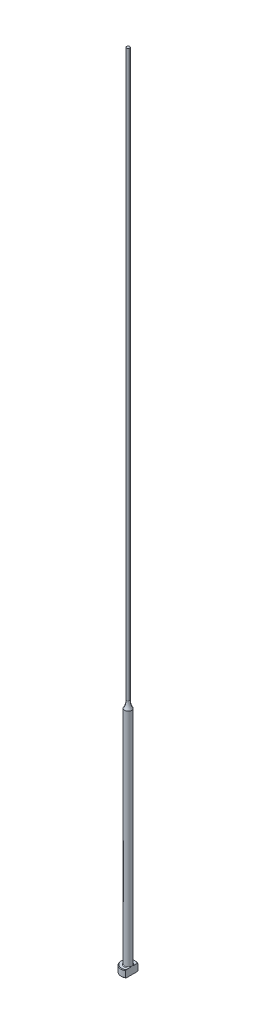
ISO-10303-21;
HEADER;
FILE_DESCRIPTION(('STEP AP214'),'2;1');
FILE_NAME('part.step','',(''),(''),'','','');
FILE_SCHEMA(('AUTOMOTIVE_DESIGN { 1 0 10303 214 1 1 1 1 }'));
ENDSEC;
DATA;
#1=APPLICATION_CONTEXT('core data for automotive mechanical design processes');
#2=APPLICATION_PROTOCOL_DEFINITION('international standard','automotive_design',2000,#1);
#3=PRODUCT_CONTEXT('',#1,'mechanical');
#4=PRODUCT('Part','Part','',(#3));
#5=PRODUCT_RELATED_PRODUCT_CATEGORY('part','',(#4));
#6=PRODUCT_DEFINITION_FORMATION('','',#4);
#7=PRODUCT_DEFINITION_CONTEXT('part definition',#1,'design');
#8=PRODUCT_DEFINITION('design','',#6,#7);
#9=PRODUCT_DEFINITION_SHAPE('','',#8);
#10=(LENGTH_UNIT() NAMED_UNIT(*) SI_UNIT(.MILLI.,.METRE.));
#11=(NAMED_UNIT(*) PLANE_ANGLE_UNIT() SI_UNIT($,.RADIAN.));
#12=(NAMED_UNIT(*) SI_UNIT($,.STERADIAN.) SOLID_ANGLE_UNIT());
#13=UNCERTAINTY_MEASURE_WITH_UNIT(LENGTH_MEASURE(1.E-05),#10,'distance_accuracy_value','');
#14=(GEOMETRIC_REPRESENTATION_CONTEXT(3) GLOBAL_UNCERTAINTY_ASSIGNED_CONTEXT((#13)) GLOBAL_UNIT_ASSIGNED_CONTEXT((#10,
#11,#12)) REPRESENTATION_CONTEXT('',''));
#15=CARTESIAN_POINT('',(0.,0.,0.));
#16=DIRECTION('',(0.,0.,1.));
#17=DIRECTION('',(1.,0.,0.));
#18=AXIS2_PLACEMENT_3D('',#15,#16,#17);
#19=CARTESIAN_POINT('',(-3.17499999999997,3.175,0.));
#20=DIRECTION('',(0.,1.,0.));
#21=DIRECTION('',(0.,0.,1.));
#22=AXIS2_PLACEMENT_3D('',#19,#20,#21);
#23=PLANE('',#22);
#24=CARTESIAN_POINT('',(0.,3.175,0.));
#25=DIRECTION('',(0.,1.,0.));
#26=DIRECTION('',(0.,0.,1.));
#27=AXIS2_PLACEMENT_3D('',#24,#25,#26);
#28=CIRCLE('',#27,2.92099999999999);
#29=CARTESIAN_POINT('',(1.58749999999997,3.175,-2.4519552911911));
#30=VERTEX_POINT('',#29);
#31=CARTESIAN_POINT('',(1.58749999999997,3.175,2.4519552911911));
#32=VERTEX_POINT('',#31);
#33=EDGE_CURVE('E105',#30,#32,#28,.T.);
#34=ORIENTED_EDGE('',*,*,#33,.T.);
#35=DIRECTION('',(0.,0.,1.));
#36=VECTOR('',#35,1.);
#37=CARTESIAN_POINT('',(1.58749999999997,3.17499999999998,2.74963065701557));
#38=LINE('',#37,#36);
#39=CARTESIAN_POINT('',(1.58749999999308,3.175,0.933255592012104));
#40=VERTEX_POINT('',#39);
#41=EDGE_CURVE('E126',#40,#32,#38,.T.);
#42=ORIENTED_EDGE('',*,*,#41,.F.);
#43=CARTESIAN_POINT('',(0.,3.175,0.));
#44=DIRECTION('',(0.,1.,0.));
#45=DIRECTION('',(0.,0.,1.));
#46=AXIS2_PLACEMENT_3D('',#43,#44,#45);
#47=CIRCLE('',#46,1.84149999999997);
#48=CARTESIAN_POINT('',(1.58749999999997,3.17500000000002,-0.933255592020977));
#49=VERTEX_POINT('',#48);
#50=EDGE_CURVE('E11',#40,#49,#47,.F.);
#51=ORIENTED_EDGE('',*,*,#50,.T.);
#52=EDGE_CURVE('E52',#30,#49,#38,.T.);
#53=ORIENTED_EDGE('',*,*,#52,.F.);
#54=EDGE_LOOP('',(#34,#42,#51,#53));
#55=FACE_BOUND('',#54,.T.);
#56=ADVANCED_FACE('F32',(#55),#23,.T.);
#57=CARTESIAN_POINT('',(0.,259.958771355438,0.));
#58=DIRECTION('',(0.,1.,0.));
#59=DIRECTION('',(0.,0.,1.));
#60=AXIS2_PLACEMENT_3D('',#57,#58,#59);
#61=CYLINDRICAL_SURFACE('',#60,3.17499999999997);
#62=CARTESIAN_POINT('',(0.,2.92100000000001,0.));
#63=DIRECTION('',(0.,1.,0.));
#64=DIRECTION('',(0.,0.,1.));
#65=AXIS2_PLACEMENT_3D('',#62,#63,#64);
#66=CIRCLE('',#65,3.17499999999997);
#67=CARTESIAN_POINT('',(1.58749999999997,2.92100000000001,2.74963065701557));
#68=VERTEX_POINT('',#67);
#69=CARTESIAN_POINT('',(1.58749999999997,2.92100000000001,-2.74963065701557));
#70=VERTEX_POINT('',#69);
#71=EDGE_CURVE('E98',#68,#70,#66,.F.);
#72=ORIENTED_EDGE('',*,*,#71,.T.);
#73=DIRECTION('',(0.,-1.,0.));
#74=VECTOR('',#73,1.);
#75=CARTESIAN_POINT('',(1.58749999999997,355.601,-2.74963065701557));
#76=LINE('',#75,#74);
#77=CARTESIAN_POINT('',(1.58749999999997,0.253999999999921,-2.74963065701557));
#78=VERTEX_POINT('',#77);
#79=EDGE_CURVE('E141',#70,#78,#76,.T.);
#80=ORIENTED_EDGE('',*,*,#79,.T.);
#81=CARTESIAN_POINT('',(0.,0.253999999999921,0.));
#82=DIRECTION('',(0.,-1.,0.));
#83=DIRECTION('',(0.,0.,-1.));
#84=AXIS2_PLACEMENT_3D('',#81,#82,#83);
#85=CIRCLE('',#84,3.17499999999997);
#86=CARTESIAN_POINT('',(1.58749999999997,0.253999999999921,2.74963065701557));
#87=VERTEX_POINT('',#86);
#88=EDGE_CURVE('E95',#78,#87,#85,.F.);
#89=ORIENTED_EDGE('',*,*,#88,.T.);
#90=DIRECTION('',(0.,-1.,0.));
#91=VECTOR('',#90,1.);
#92=CARTESIAN_POINT('',(1.58749999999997,355.601,2.74963065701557));
#93=LINE('',#92,#91);
#94=EDGE_CURVE('E88',#68,#87,#93,.T.);
#95=ORIENTED_EDGE('',*,*,#94,.F.);
#96=EDGE_LOOP('',(#72,#80,#89,#95));
#97=FACE_BOUND('',#96,.T.);
#98=ADVANCED_FACE('F191',(#97),#61,.T.);
#99=CARTESIAN_POINT('',(0.,0.,0.));
#100=DIRECTION('',(0.,-1.,0.));
#101=DIRECTION('',(0.,0.,-1.));
#102=AXIS2_PLACEMENT_3D('',#99,#100,#101);
#103=PLANE('',#102);
#104=CARTESIAN_POINT('',(0.,0.,0.));
#105=DIRECTION('',(0.,-1.,0.));
#106=DIRECTION('',(0.,0.,-1.));
#107=AXIS2_PLACEMENT_3D('',#104,#105,#106);
#108=CIRCLE('',#107,2.92100000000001);
#109=CARTESIAN_POINT('',(1.58749999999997,0.,2.45195529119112));
#110=VERTEX_POINT('',#109);
#111=CARTESIAN_POINT('',(1.58749999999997,0.,-2.45195529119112));
#112=VERTEX_POINT('',#111);
#113=EDGE_CURVE('E93',#110,#112,#108,.T.);
#114=ORIENTED_EDGE('',*,*,#113,.T.);
#115=DIRECTION('',(0.,0.,1.));
#116=VECTOR('',#115,1.);
#117=CARTESIAN_POINT('',(1.58749999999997,0.,2.74963065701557));
#118=LINE('',#117,#116);
#119=EDGE_CURVE('E78',#112,#110,#118,.T.);
#120=ORIENTED_EDGE('',*,*,#119,.T.);
#121=EDGE_LOOP('',(#114,#120));
#122=FACE_BOUND('',#121,.T.);
#123=ADVANCED_FACE('F97',(#122),#103,.T.);
#124=CARTESIAN_POINT('',(0.,3.17499999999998,0.));
#125=DIRECTION('',(0.,-1.,0.));
#126=DIRECTION('',(0.,0.,-1.));
#127=AXIS2_PLACEMENT_3D('',#124,#125,#126);
#128=CONICAL_SURFACE('',#127,2.92100000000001,0.785398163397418);
#129=ORIENTED_EDGE('',*,*,#71,.F.);
#130=CARTESIAN_POINT('',(1.58749999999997,-0.161620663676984,-6.0529050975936));
#131=CARTESIAN_POINT('',(1.58749999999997,-0.0288893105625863,-5.91567682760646));
#132=CARTESIAN_POINT('',(1.58749999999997,0.103699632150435,-5.77831035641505));
#133=CARTESIAN_POINT('',(1.58749999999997,0.368508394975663,-5.50321874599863));
#134=CARTESIAN_POINT('',(1.58749999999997,0.5007282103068,-5.3654936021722));
#135=CARTESIAN_POINT('',(1.58749999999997,0.764778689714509,-5.08953516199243));
#136=CARTESIAN_POINT('',(1.58749999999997,0.896609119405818,-4.95130164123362));
#137=CARTESIAN_POINT('',(1.58749999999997,1.15968706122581,-4.67428233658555));
#138=CARTESIAN_POINT('',(1.58749999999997,1.29093457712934,-4.5354965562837));
#139=CARTESIAN_POINT('',(1.58749999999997,1.55007705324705,-4.25997724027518));
#140=CARTESIAN_POINT('',(1.58749999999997,1.67798684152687,-4.12325766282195));
#141=CARTESIAN_POINT('',(1.58749999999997,1.9328486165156,-3.84892898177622));
#142=CARTESIAN_POINT('',(1.58749999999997,2.05980060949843,-3.71131988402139));
#143=CARTESIAN_POINT('',(1.58749999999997,2.31237508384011,-3.43493978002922));
#144=CARTESIAN_POINT('',(1.58749999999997,2.43799784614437,-3.29616903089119));
#145=CARTESIAN_POINT('',(1.58749999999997,2.68741369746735,-3.01699558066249));
#146=CARTESIAN_POINT('',(1.58749999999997,2.81120686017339,-2.8765929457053));
#147=CARTESIAN_POINT('',(1.58749999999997,3.00875865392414,-2.64816703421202));
#148=CARTESIAN_POINT('',(1.58749999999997,3.08336151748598,-2.56087478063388));
#149=CARTESIAN_POINT('',(1.58749999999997,3.23123871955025,-2.385154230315));
#150=CARTESIAN_POINT('',(1.58749999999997,3.30451292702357,-2.29672582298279));
#151=CARTESIAN_POINT('',(1.58749999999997,3.45004422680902,-2.11747400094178));
#152=CARTESIAN_POINT('',(1.58749999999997,3.52228237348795,-2.02663514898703));
#153=CARTESIAN_POINT('',(1.58749999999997,3.66423097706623,-1.84302524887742));
#154=CARTESIAN_POINT('',(1.58749999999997,3.73394203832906,-1.75025467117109));
#155=CARTESIAN_POINT('',(1.58749999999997,3.87080633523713,-1.56067475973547));
#156=CARTESIAN_POINT('',(1.58749999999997,3.93790459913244,-1.46382547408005));
#157=CARTESIAN_POINT('',(1.58749999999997,4.06669147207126,-1.26632594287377));
#158=CARTESIAN_POINT('',(1.58749999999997,4.12837264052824,-1.16567073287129));
#159=CARTESIAN_POINT('',(1.58749999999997,4.21402252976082,-1.01165766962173));
#160=CARTESIAN_POINT('',(1.58749999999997,4.2412792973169,-0.960142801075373));
#161=CARTESIAN_POINT('',(1.58749999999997,4.29309798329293,-0.85578092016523));
#162=CARTESIAN_POINT('',(1.58749999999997,4.3176594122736,-0.802933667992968));
#163=CARTESIAN_POINT('',(1.58749999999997,4.38614656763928,-0.642461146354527));
#164=CARTESIAN_POINT('',(1.58749999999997,4.42510149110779,-0.532518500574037));
#165=CARTESIAN_POINT('',(1.58749999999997,4.46726244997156,-0.367680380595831));
#166=CARTESIAN_POINT('',(1.58749999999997,4.47844427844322,-0.314802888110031));
#167=CARTESIAN_POINT('',(1.58749999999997,4.49576654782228,-0.208209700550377));
#168=CARTESIAN_POINT('',(1.58749999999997,4.50190743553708,-0.154494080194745));
#169=CARTESIAN_POINT('',(1.58749999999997,4.50871296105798,-0.0468792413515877));
#170=CARTESIAN_POINT('',(1.58749999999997,4.50939451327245,0.00701889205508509));
#171=CARTESIAN_POINT('',(1.58749999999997,4.5052767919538,0.114606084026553));
#172=CARTESIAN_POINT('',(1.58749999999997,4.5004770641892,0.16829512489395));
#173=CARTESIAN_POINT('',(1.58749999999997,4.48579689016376,0.274485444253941));
#174=CARTESIAN_POINT('',(1.58749999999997,4.47596081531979,0.326992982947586));
#175=CARTESIAN_POINT('',(1.58749999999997,4.4518180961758,0.430974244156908));
#176=CARTESIAN_POINT('',(1.58749999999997,4.43750969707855,0.482447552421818));
#177=CARTESIAN_POINT('',(1.58749999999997,4.40502489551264,0.58446088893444));
#178=CARTESIAN_POINT('',(1.58749999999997,4.38682724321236,0.634994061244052));
#179=CARTESIAN_POINT('',(1.58749999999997,4.34729308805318,0.734789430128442));
#180=CARTESIAN_POINT('',(1.58749999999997,4.32595722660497,0.784051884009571));
#181=CARTESIAN_POINT('',(1.58749999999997,4.25791922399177,0.93054934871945));
#182=CARTESIAN_POINT('',(1.58749999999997,4.20736047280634,1.02598802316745));
#183=CARTESIAN_POINT('',(1.58749999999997,4.09955451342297,1.21304313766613));
#184=CARTESIAN_POINT('',(1.58749999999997,4.04229912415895,1.30465471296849));
#185=CARTESIAN_POINT('',(1.58749999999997,3.92308746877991,1.48526211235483));
#186=CARTESIAN_POINT('',(1.58749999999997,3.86111349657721,1.57424615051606));
#187=CARTESIAN_POINT('',(1.58749999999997,3.73408621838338,1.74990003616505));
#188=CARTESIAN_POINT('',(1.58749999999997,3.66903444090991,1.83657099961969));
#189=CARTESIAN_POINT('',(1.58749999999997,3.53583371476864,2.009317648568));
#190=CARTESIAN_POINT('',(1.58749999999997,3.46765527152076,2.09537048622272));
#191=CARTESIAN_POINT('',(1.58749999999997,3.32960643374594,2.26611736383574));
#192=CARTESIAN_POINT('',(1.58749999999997,3.25973586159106,2.35081125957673));
#193=CARTESIAN_POINT('',(1.58749999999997,3.04858139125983,2.60290121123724));
#194=CARTESIAN_POINT('',(1.58749999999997,2.90542388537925,2.7687253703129));
#195=CARTESIAN_POINT('',(1.58749999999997,2.64069522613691,3.06970913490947));
#196=CARTESIAN_POINT('',(1.58749999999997,2.5195945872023,3.20528660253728));
#197=CARTESIAN_POINT('',(1.58749999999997,2.27590400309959,3.47510321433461));
#198=CARTESIAN_POINT('',(1.58749999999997,2.1533140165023,3.60934232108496));
#199=CARTESIAN_POINT('',(1.58749999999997,1.9069423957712,3.87695374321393));
#200=CARTESIAN_POINT('',(1.58749999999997,1.78315974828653,4.01032512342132));
#201=CARTESIAN_POINT('',(1.58749999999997,1.53478104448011,4.2763088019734));
#202=CARTESIAN_POINT('',(1.58749999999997,1.41018498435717,4.40892109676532));
#203=CARTESIAN_POINT('',(1.58749999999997,1.04574684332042,4.79499418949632));
#204=CARTESIAN_POINT('',(1.58749999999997,0.805076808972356,5.04767313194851));
#205=CARTESIAN_POINT('',(1.58749999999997,0.44312150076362,5.42550911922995));
#206=CARTESIAN_POINT('',(1.58749999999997,0.322378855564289,5.55118772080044));
#207=CARTESIAN_POINT('',(1.58749999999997,0.0805914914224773,5.8022520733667));
#208=CARTESIAN_POINT('',(1.58749999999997,-0.0404532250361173,5.92763782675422));
#209=CARTESIAN_POINT('',(1.58749999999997,-0.161620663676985,6.0529050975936));
#210=B_SPLINE_CURVE_WITH_KNOTS('',3,(#130,#131,#132,#133,#134,#135,#136,#137,#138,#139,#140,
#141,#142,#143,#144,#145,#146,#147,#148,#149,#150,#151,#152,#153,#154,#155,#156,#157,#158,#159,
#160,#161,#162,#163,#164,#165,#166,#167,#168,#169,#170,#171,#172,#173,#174,#175,#176,#177,#178,
#179,#180,#181,#182,#183,#184,#185,#186,#187,#188,#189,#190,#191,#192,#193,#194,#195,#196,#197,
#198,#199,#200,#201,#202,#203,#204,#205,#206,#207,#208,#209),.UNSPECIFIED.,.F.,.F.,(4,2,2,2,2,2,
2,2,2,2,2,2,2,2,2,2,2,2,2,2,2,2,2,2,2,2,2,2,2,2,2,2,2,2,2,2,2,2,2,4),(0.,0.572750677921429,
1.14550874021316,1.71856057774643,2.29160869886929,2.85328006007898,3.41494773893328,
3.97649423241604,4.53801804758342,4.88249307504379,5.2270018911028,5.57515326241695,
5.92322081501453,6.27657800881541,6.63041319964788,6.80518126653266,6.97998101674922,
7.32824262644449,7.49018491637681,7.65211285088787,7.81353889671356,7.97497832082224,
8.13501929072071,8.29512313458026,8.45612518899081,8.61709438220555,8.94062993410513,
9.26456495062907,9.58978187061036,9.91483894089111,10.2441741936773,10.5735441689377,
11.2306812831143,11.7760337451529,12.3214014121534,12.8672825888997,13.4131663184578,
14.4600164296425,14.9828595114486,15.505698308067),.UNSPECIFIED.);
#211=EDGE_CURVE('E118',#32,#68,#210,.T.);
#212=ORIENTED_EDGE('',*,*,#211,.F.);
#213=ORIENTED_EDGE('',*,*,#33,.F.);
#214=EDGE_CURVE('E117',#70,#30,#210,.T.);
#215=ORIENTED_EDGE('',*,*,#214,.F.);
#216=EDGE_LOOP('',(#129,#212,#213,#215));
#217=FACE_BOUND('',#216,.T.);
#218=ADVANCED_FACE('F162',(#217),#128,.T.);
#219=CARTESIAN_POINT('',(0.,0.253999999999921,0.));
#220=DIRECTION('',(0.,1.,0.));
#221=DIRECTION('',(0.,0.,1.));
#222=AXIS2_PLACEMENT_3D('',#219,#220,#221);
#223=CONICAL_SURFACE('',#222,3.17499999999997,0.785398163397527);
#224=ORIENTED_EDGE('',*,*,#88,.F.);
#225=CARTESIAN_POINT('',(1.58749999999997,3.33662066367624,6.0529050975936));
#226=CARTESIAN_POINT('',(1.58749999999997,3.20388931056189,5.91567682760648));
#227=CARTESIAN_POINT('',(1.58749999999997,3.07130036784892,5.7783103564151));
#228=CARTESIAN_POINT('',(1.58749999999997,2.80649160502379,5.50321874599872));
#229=CARTESIAN_POINT('',(1.58749999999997,2.6742717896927,5.36549360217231));
#230=CARTESIAN_POINT('',(1.58749999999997,2.41022131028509,5.08953516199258));
#231=CARTESIAN_POINT('',(1.58749999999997,2.27839088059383,4.95130164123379));
#232=CARTESIAN_POINT('',(1.58749999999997,2.01531293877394,4.67428233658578));
#233=CARTESIAN_POINT('',(1.58749999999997,1.88406542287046,4.53549655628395));
#234=CARTESIAN_POINT('',(1.58749999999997,1.62492294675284,4.25997724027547));
#235=CARTESIAN_POINT('',(1.58749999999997,1.49701315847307,4.12325766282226));
#236=CARTESIAN_POINT('',(1.58749999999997,1.24215138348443,3.84892898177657));
#237=CARTESIAN_POINT('',(1.58749999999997,1.11519939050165,3.71131988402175));
#238=CARTESIAN_POINT('',(1.58749999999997,0.862624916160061,3.43493978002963));
#239=CARTESIAN_POINT('',(1.58749999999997,0.737002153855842,3.29616903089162));
#240=CARTESIAN_POINT('',(1.58749999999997,0.487586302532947,3.01699558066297));
#241=CARTESIAN_POINT('',(1.58749999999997,0.363793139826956,2.8765929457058));
#242=CARTESIAN_POINT('',(1.58749999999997,0.166241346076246,2.64816703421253));
#243=CARTESIAN_POINT('',(1.58749999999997,0.0916384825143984,2.56087478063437));
#244=CARTESIAN_POINT('',(1.58749999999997,-0.0562387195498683,2.38515423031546));
#245=CARTESIAN_POINT('',(1.58749999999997,-0.129512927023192,2.29672582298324));
#246=CARTESIAN_POINT('',(1.58749999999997,-0.275044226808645,2.1174740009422));
#247=CARTESIAN_POINT('',(1.58749999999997,-0.347282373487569,2.02663514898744));
#248=CARTESIAN_POINT('',(1.58749999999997,-0.489230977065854,1.8430252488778));
#249=CARTESIAN_POINT('',(1.58749999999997,-0.558942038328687,1.75025467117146));
#250=CARTESIAN_POINT('',(1.58749999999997,-0.695806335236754,1.5606747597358));
#251=CARTESIAN_POINT('',(1.58749999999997,-0.762904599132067,1.46382547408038));
#252=CARTESIAN_POINT('',(1.58749999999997,-0.89169147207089,1.26632594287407));
#253=CARTESIAN_POINT('',(1.58749999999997,-0.953372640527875,1.16567073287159));
#254=CARTESIAN_POINT('',(1.58749999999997,-1.03902252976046,1.01165766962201));
#255=CARTESIAN_POINT('',(1.58749999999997,-1.06627929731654,0.960142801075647));
#256=CARTESIAN_POINT('',(1.58749999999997,-1.11809798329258,0.855780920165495));
#257=CARTESIAN_POINT('',(1.58749999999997,-1.14265941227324,0.802933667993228));
#258=CARTESIAN_POINT('',(1.58749999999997,-1.21114656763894,0.642461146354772));
#259=CARTESIAN_POINT('',(1.58749999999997,-1.25010149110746,0.532518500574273));
#260=CARTESIAN_POINT('',(1.58749999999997,-1.29226244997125,0.367680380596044));
#261=CARTESIAN_POINT('',(1.58749999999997,-1.30344427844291,0.314802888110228));
#262=CARTESIAN_POINT('',(1.58749999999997,-1.32076654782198,0.208209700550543));
#263=CARTESIAN_POINT('',(1.58749999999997,-1.32690743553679,0.154494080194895));
#264=CARTESIAN_POINT('',(1.58749999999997,-1.3337129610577,0.0468792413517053));
#265=CARTESIAN_POINT('',(1.58749999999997,-1.33439451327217,-0.00701889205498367));
#266=CARTESIAN_POINT('',(1.58749999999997,-1.33027679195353,-0.114606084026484));
#267=CARTESIAN_POINT('',(1.58749999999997,-1.32547706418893,-0.168295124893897));
#268=CARTESIAN_POINT('',(1.58749999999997,-1.31079689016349,-0.274485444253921));
#269=CARTESIAN_POINT('',(1.58749999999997,-1.30096081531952,-0.326992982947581));
#270=CARTESIAN_POINT('',(1.58749999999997,-1.27681809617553,-0.430974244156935));
#271=CARTESIAN_POINT('',(1.58749999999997,-1.26250969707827,-0.48244755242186));
#272=CARTESIAN_POINT('',(1.58749999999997,-1.23002489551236,-0.584460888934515));
#273=CARTESIAN_POINT('',(1.58749999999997,-1.21182724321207,-0.634994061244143));
#274=CARTESIAN_POINT('',(1.58749999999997,-1.17229308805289,-0.734789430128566));
#275=CARTESIAN_POINT('',(1.58749999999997,-1.15095722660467,-0.784051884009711));
#276=CARTESIAN_POINT('',(1.58749999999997,-1.08291922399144,-0.930549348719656));
#277=CARTESIAN_POINT('',(1.58749999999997,-1.03236047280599,-1.0259880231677));
#278=CARTESIAN_POINT('',(1.58749999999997,-0.924554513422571,-1.21304313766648));
#279=CARTESIAN_POINT('',(1.58749999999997,-0.867299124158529,-1.30465471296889));
#280=CARTESIAN_POINT('',(1.58749999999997,-0.748087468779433,-1.48526211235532));
#281=CARTESIAN_POINT('',(1.58749999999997,-0.686113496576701,-1.5742461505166));
#282=CARTESIAN_POINT('',(1.58749999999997,-0.559086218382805,-1.74990003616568));
#283=CARTESIAN_POINT('',(1.58749999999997,-0.494034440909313,-1.83657099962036));
#284=CARTESIAN_POINT('',(1.58749999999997,-0.360833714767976,-2.00931764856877));
#285=CARTESIAN_POINT('',(1.58749999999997,-0.292655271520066,-2.09537048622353));
#286=CARTESIAN_POINT('',(1.58749999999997,-0.154606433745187,-2.26611736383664));
#287=CARTESIAN_POINT('',(1.58749999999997,-0.0847358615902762,-2.35081125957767));
#288=CARTESIAN_POINT('',(1.58749999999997,0.126418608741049,-2.60290121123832));
#289=CARTESIAN_POINT('',(1.58749999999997,0.269576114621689,-2.76872537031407));
#290=CARTESIAN_POINT('',(1.58749999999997,0.534304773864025,-3.06970913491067));
#291=CARTESIAN_POINT('',(1.58749999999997,0.655405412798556,-3.20528660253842));
#292=CARTESIAN_POINT('',(1.58749999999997,0.899095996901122,-3.47510321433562));
#293=CARTESIAN_POINT('',(1.58749999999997,1.02168598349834,-3.60934232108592));
#294=CARTESIAN_POINT('',(1.58749999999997,1.26805760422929,-3.87695374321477));
#295=CARTESIAN_POINT('',(1.58749999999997,1.39184025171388,-4.0103251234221));
#296=CARTESIAN_POINT('',(1.58749999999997,1.64021895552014,-4.27630880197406));
#297=CARTESIAN_POINT('',(1.58749999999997,1.76481501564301,-4.40892109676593));
#298=CARTESIAN_POINT('',(1.58749999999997,2.12925315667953,-4.79499418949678));
#299=CARTESIAN_POINT('',(1.58749999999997,2.36992319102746,-5.04767313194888));
#300=CARTESIAN_POINT('',(1.58749999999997,2.73187849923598,-5.42550911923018));
#301=CARTESIAN_POINT('',(1.58749999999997,2.85262114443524,-5.55118772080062));
#302=CARTESIAN_POINT('',(1.58749999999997,3.09440850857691,-5.80225207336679));
#303=CARTESIAN_POINT('',(1.58749999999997,3.21545322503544,-5.92763782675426));
#304=CARTESIAN_POINT('',(1.58749999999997,3.33662066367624,-6.0529050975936));
#305=B_SPLINE_CURVE_WITH_KNOTS('',3,(#225,#226,#227,#228,#229,#230,#231,#232,#233,#234,#235,
#236,#237,#238,#239,#240,#241,#242,#243,#244,#245,#246,#247,#248,#249,#250,#251,#252,#253,#254,
#255,#256,#257,#258,#259,#260,#261,#262,#263,#264,#265,#266,#267,#268,#269,#270,#271,#272,#273,
#274,#275,#276,#277,#278,#279,#280,#281,#282,#283,#284,#285,#286,#287,#288,#289,#290,#291,#292,
#293,#294,#295,#296,#297,#298,#299,#300,#301,#302,#303,#304),.UNSPECIFIED.,.F.,.F.,(4,2,2,2,2,2,
2,2,2,2,2,2,2,2,2,2,2,2,2,2,2,2,2,2,2,2,2,2,2,2,2,2,2,2,2,2,2,2,2,4),(0.,0.572750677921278,
1.14550874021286,1.71856057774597,2.29160869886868,2.85328006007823,3.4149477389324,
3.97649423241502,4.53801804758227,4.88249307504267,5.22700189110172,5.5751532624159,
5.92322081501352,6.27657800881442,6.63041319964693,6.80518126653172,6.9799810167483,
7.3282426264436,7.49018491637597,7.65211285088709,7.81353889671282,7.97497832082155,
8.13501929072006,8.29512313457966,8.45612518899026,8.61709438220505,8.9406299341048,
9.2645649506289,9.58978187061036,9.91483894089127,10.2441741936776,10.5735441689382,
11.2306812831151,11.7760337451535,12.3214014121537,12.8672825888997,13.4131663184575,
14.4600164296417,14.9828595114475,15.5056983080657),.UNSPECIFIED.);
#306=EDGE_CURVE('E81',#112,#78,#305,.T.);
#307=ORIENTED_EDGE('',*,*,#306,.F.);
#308=ORIENTED_EDGE('',*,*,#113,.F.);
#309=EDGE_CURVE('E84',#87,#110,#305,.T.);
#310=ORIENTED_EDGE('',*,*,#309,.F.);
#311=EDGE_LOOP('',(#224,#307,#308,#310));
#312=FACE_BOUND('',#311,.T.);
#313=ADVANCED_FACE('F92',(#312),#223,.T.);
#314=CARTESIAN_POINT('',(0.,3.42900000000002,0.));
#315=DIRECTION('',(0.,1.,0.));
#316=DIRECTION('',(0.,0.,1.));
#317=AXIS2_PLACEMENT_3D('',#314,#315,#316);
#318=TOROIDAL_SURFACE('',#317,1.84149999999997,0.254);
#319=CARTESIAN_POINT('',(1.58749999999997,3.42900000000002,0.));
#320=CARTESIAN_POINT('',(1.58749999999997,3.42899942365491,-1.9220514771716E-10));
#321=CARTESIAN_POINT('',(1.58749999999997,3.42899884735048,-1.2261161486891E-07));
#322=CARTESIAN_POINT('',(1.58749999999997,3.42899773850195,-5.09676365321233E-07));
#323=CARTESIAN_POINT('',(1.58749999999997,3.42899720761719,-7.78176328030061E-07));
#324=CARTESIAN_POINT('',(1.58749999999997,3.42899614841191,-1.42307272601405E-06));
#325=CARTESIAN_POINT('',(1.58749999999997,3.42899562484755,-1.80713867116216E-06));
#326=CARTESIAN_POINT('',(1.58749999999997,3.42899463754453,-2.63494846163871E-06));
#327=CARTESIAN_POINT('',(1.58749999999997,3.42899417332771,-3.07814756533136E-06));
#328=CARTESIAN_POINT('',(1.58749999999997,3.42899261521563,-4.66897357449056E-06));
#329=CARTESIAN_POINT('',(1.58749999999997,3.42899159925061,-5.89404908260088E-06));
#330=CARTESIAN_POINT('',(1.58749999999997,3.42898979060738,-8.42427511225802E-06));
#331=CARTESIAN_POINT('',(1.58749999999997,3.42898899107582,-9.7248057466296E-06));
#332=CARTESIAN_POINT('',(1.58749999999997,3.42898598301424,-1.48060601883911E-05));
#333=CARTESIAN_POINT('',(1.58749999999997,3.42898393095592,-1.86838281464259E-05));
#334=CARTESIAN_POINT('',(1.58749999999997,3.42898057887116,-2.63261117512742E-05));
#335=CARTESIAN_POINT('',(1.58749999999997,3.42897922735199,-3.00687417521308E-05));
#336=CARTESIAN_POINT('',(1.58749999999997,3.42897347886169,-4.60276298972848E-05));
#337=CARTESIAN_POINT('',(1.58749999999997,3.42896911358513,-5.8247019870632E-05));
#338=CARTESIAN_POINT('',(1.58749999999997,3.42896211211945,-8.11070097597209E-05));
#339=CARTESIAN_POINT('',(1.58749999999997,3.42895931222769,-9.16953114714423E-05));
#340=CARTESIAN_POINT('',(1.58749999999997,3.42893712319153,-0.000168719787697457));
#341=CARTESIAN_POINT('',(1.58749999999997,3.42890881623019,-0.000232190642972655));
#342=CARTESIAN_POINT('',(1.58749999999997,3.42880276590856,-0.000479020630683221));
#343=CARTESIAN_POINT('',(1.58749999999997,3.42873165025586,-0.00066443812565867));
#344=CARTESIAN_POINT('',(1.58749999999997,3.42845137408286,-0.0013844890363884));
#345=CARTESIAN_POINT('',(1.58749999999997,3.42823526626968,-0.00191701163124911));
#346=CARTESIAN_POINT('',(1.58749999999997,3.42735449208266,-0.00409774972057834));
#347=CARTESIAN_POINT('',(1.58749999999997,3.42669768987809,-0.00574830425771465));
#348=CARTESIAN_POINT('',(1.58749999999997,3.4174405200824,-0.0289985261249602));
#349=CARTESIAN_POINT('',(1.58749999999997,3.40878325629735,-0.0505816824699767));
#350=CARTESIAN_POINT('',(1.58749999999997,3.39189297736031,-0.0929947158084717));
#351=CARTESIAN_POINT('',(1.58749999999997,3.38365605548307,-0.11382315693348));
#352=CARTESIAN_POINT('',(1.58749999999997,3.36635393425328,-0.157956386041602));
#353=CARTESIAN_POINT('',(1.58749999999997,3.35730391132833,-0.181267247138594));
#354=CARTESIAN_POINT('',(1.58749999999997,3.33936775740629,-0.228222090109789));
#355=CARTESIAN_POINT('',(1.58749999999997,3.33048420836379,-0.25186705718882));
#356=CARTESIAN_POINT('',(1.58749999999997,3.30894496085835,-0.310512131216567));
#357=CARTESIAN_POINT('',(1.58749999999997,3.29649449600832,-0.345588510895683));
#358=CARTESIAN_POINT('',(1.58749999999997,3.27296975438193,-0.415278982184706));
#359=CARTESIAN_POINT('',(1.58749999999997,3.26186987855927,-0.449884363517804));
#360=CARTESIAN_POINT('',(1.58749999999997,3.2395832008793,-0.524471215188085));
#361=CARTESIAN_POINT('',(1.58749999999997,3.22860862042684,-0.564517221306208));
#362=CARTESIAN_POINT('',(1.58749999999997,3.20902534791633,-0.645529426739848));
#363=CARTESIAN_POINT('',(1.58749999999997,3.20043582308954,-0.686500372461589));
#364=CARTESIAN_POINT('',(1.58749999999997,3.18611712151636,-0.771546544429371));
#365=CARTESIAN_POINT('',(1.58749999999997,3.18059550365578,-0.815658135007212));
#366=CARTESIAN_POINT('',(1.58749999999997,3.17455396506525,-0.904117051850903));
#367=CARTESIAN_POINT('',(1.58749999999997,3.17401361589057,-0.948462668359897));
#368=CARTESIAN_POINT('',(1.58749999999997,3.17898948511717,-1.02531896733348));
#369=CARTESIAN_POINT('',(1.58749999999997,3.1829739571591,-1.05792141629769));
#370=CARTESIAN_POINT('',(1.58749999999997,3.19569167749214,-1.12184393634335));
#371=CARTESIAN_POINT('',(1.58749999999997,3.20436049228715,-1.1531753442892));
#372=CARTESIAN_POINT('',(1.58749999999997,3.22236152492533,-1.19946468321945));
#373=CARTESIAN_POINT('',(1.58749999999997,3.2295150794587,-1.21526783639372));
#374=CARTESIAN_POINT('',(1.58749999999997,3.24587062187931,-1.24583726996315));
#375=CARTESIAN_POINT('',(1.58749999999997,3.25507530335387,-1.26060215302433));
#376=CARTESIAN_POINT('',(1.58749999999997,3.27378481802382,-1.28575815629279));
#377=CARTESIAN_POINT('',(1.58749999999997,3.28289001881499,-1.29644383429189));
#378=CARTESIAN_POINT('',(1.58749999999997,3.30268460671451,-1.31623154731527));
#379=CARTESIAN_POINT('',(1.58749999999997,3.31337067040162,-1.32533681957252));
#380=CARTESIAN_POINT('',(1.58749999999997,3.33349977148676,-1.33941140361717));
#381=CARTESIAN_POINT('',(1.58749999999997,3.34261446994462,-1.34484814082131));
#382=CARTESIAN_POINT('',(1.58749999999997,3.36161455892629,-1.35416329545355));
#383=CARTESIAN_POINT('',(1.58749999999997,3.37149946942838,-1.35804267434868));
#384=CARTESIAN_POINT('',(1.58749999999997,3.39188678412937,-1.36398436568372));
#385=CARTESIAN_POINT('',(1.58749999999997,3.40239309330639,-1.36603350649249));
#386=CARTESIAN_POINT('',(1.58749999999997,3.42360372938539,-1.3680840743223));
#387=CARTESIAN_POINT('',(1.58749999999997,3.43430795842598,-1.36808648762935));
#388=CARTESIAN_POINT('',(1.58749999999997,3.45433283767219,-1.36616208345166));
#389=CARTESIAN_POINT('',(1.58749999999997,3.46367506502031,-1.36444960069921));
#390=CARTESIAN_POINT('',(1.58749999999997,3.48195519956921,-1.35953338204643));
#391=CARTESIAN_POINT('',(1.58749999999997,3.49089304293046,-1.3563294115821));
#392=CARTESIAN_POINT('',(1.58749999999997,3.50850302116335,-1.34848006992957));
#393=CARTESIAN_POINT('',(1.58749999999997,3.5171531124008,-1.34378578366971));
#394=CARTESIAN_POINT('',(1.58749999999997,3.53371257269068,-1.33324445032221));
#395=CARTESIAN_POINT('',(1.58749999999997,3.54162163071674,-1.32739692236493));
#396=CARTESIAN_POINT('',(1.58749999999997,3.56107121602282,-1.31107304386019));
#397=CARTESIAN_POINT('',(1.58749999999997,3.57202221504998,-1.29989286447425));
#398=CARTESIAN_POINT('',(1.58749999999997,3.59202509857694,-1.27593566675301));
#399=CARTESIAN_POINT('',(1.58749999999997,3.60107086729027,-1.26315370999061));
#400=CARTESIAN_POINT('',(1.58749999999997,3.62186023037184,-1.22930733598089));
#401=CARTESIAN_POINT('',(1.58749999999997,3.63240584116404,-1.20751096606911));
#402=CARTESIAN_POINT('',(1.58749999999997,3.65004643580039,-1.16266144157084));
#403=CARTESIAN_POINT('',(1.58749999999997,3.65714435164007,-1.13960937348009));
#404=CARTESIAN_POINT('',(1.58749999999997,3.67265428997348,-1.07603916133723));
#405=CARTESIAN_POINT('',(1.58749999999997,3.67834921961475,-1.03486686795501));
#406=CARTESIAN_POINT('',(1.58749999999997,3.68382880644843,-0.951558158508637));
#407=CARTESIAN_POINT('',(1.58749999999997,3.68350976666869,-0.909417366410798));
#408=CARTESIAN_POINT('',(1.58749999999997,3.67745397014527,-0.811383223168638));
#409=CARTESIAN_POINT('',(1.58749999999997,3.66993873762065,-0.755610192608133));
#410=CARTESIAN_POINT('',(1.58749999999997,3.64933373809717,-0.644937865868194));
#411=CARTESIAN_POINT('',(1.58749999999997,3.63621897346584,-0.59004364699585));
#412=CARTESIAN_POINT('',(1.58749999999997,3.60740922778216,-0.485757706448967));
#413=CARTESIAN_POINT('',(1.58749999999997,3.59201096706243,-0.436281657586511));
#414=CARTESIAN_POINT('',(1.58749999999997,3.55922497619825,-0.338551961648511));
#415=CARTESIAN_POINT('',(1.58749999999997,3.5418584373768,-0.290291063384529));
#416=CARTESIAN_POINT('',(1.58749999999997,3.51760237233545,-0.225557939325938));
#417=CARTESIAN_POINT('',(1.58749999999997,3.51126413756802,-0.208874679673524));
#418=CARTESIAN_POINT('',(1.58749999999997,3.49830042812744,-0.17512392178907));
#419=CARTESIAN_POINT('',(1.58749999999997,3.49167176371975,-0.158057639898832));
#420=CARTESIAN_POINT('',(1.58749999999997,3.47585523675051,-0.117638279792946));
#421=CARTESIAN_POINT('',(1.58749999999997,3.46662970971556,-0.0943002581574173));
#422=CARTESIAN_POINT('',(1.58749999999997,3.44889695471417,-0.0497824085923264));
#423=CARTESIAN_POINT('',(1.58749999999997,3.44040039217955,-0.028598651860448));
#424=CARTESIAN_POINT('',(1.58749999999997,3.43130364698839,-0.00575168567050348));
#425=CARTESIAN_POINT('',(1.58749999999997,3.43064818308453,-0.00410451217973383));
#426=CARTESIAN_POINT('',(1.58749999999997,3.42976776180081,-0.00192459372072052));
#427=CARTESIAN_POINT('',(1.58749999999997,3.42955062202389,-0.00138952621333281));
#428=CARTESIAN_POINT('',(1.58749999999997,3.42926908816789,-0.000666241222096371));
#429=CARTESIAN_POINT('',(1.58749999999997,3.42919771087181,-0.000480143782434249));
#430=CARTESIAN_POINT('',(1.58749999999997,3.42909131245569,-0.000232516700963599));
#431=CARTESIAN_POINT('',(1.58749999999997,3.42906294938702,-0.000168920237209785));
#432=CARTESIAN_POINT('',(1.58749999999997,3.42904072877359,-9.17527162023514E-05));
#433=CARTESIAN_POINT('',(1.58749999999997,3.42903792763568,-8.11550293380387E-05));
#434=CARTESIAN_POINT('',(1.58749999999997,3.42903091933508,-5.82743948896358E-05));
#435=CARTESIAN_POINT('',(1.58749999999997,3.42902654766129,-4.60440001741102E-05));
#436=CARTESIAN_POINT('',(1.58749999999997,3.42902079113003,-3.00727682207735E-05));
#437=CARTESIAN_POINT('',(1.58749999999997,3.42901943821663,-2.63286807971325E-05));
#438=CARTESIAN_POINT('',(1.58749999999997,3.42901608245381,-1.86836529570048E-05));
#439=CARTESIAN_POINT('',(1.58749999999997,3.4290140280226,-1.48046517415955E-05));
#440=CARTESIAN_POINT('',(1.58749999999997,3.42901101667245,-9.72223943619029E-06));
#441=CARTESIAN_POINT('',(1.58749999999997,3.42901021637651,-8.42159649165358E-06));
#442=CARTESIAN_POINT('',(1.58749999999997,3.42900840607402,-5.89129729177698E-06));
#443=CARTESIAN_POINT('',(1.58749999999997,3.42900738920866,-4.66626867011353E-06));
#444=CARTESIAN_POINT('',(1.58749999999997,3.42900582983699,-3.07568803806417E-06));
#445=CARTESIAN_POINT('',(1.58749999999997,3.42900536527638,-2.63259565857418E-06));
#446=CARTESIAN_POINT('',(1.58749999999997,3.4290043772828,-1.80506085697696E-06));
#447=CARTESIAN_POINT('',(1.58749999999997,3.42900385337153,-1.42116387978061E-06));
#448=CARTESIAN_POINT('',(1.58749999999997,3.42900279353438,-7.76675643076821E-07));
#449=CARTESIAN_POINT('',(1.58749999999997,3.42900226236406,-5.08406487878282E-07));
#450=CARTESIAN_POINT('',(1.58749999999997,3.42900115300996,-1.21901887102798E-07));
#451=CARTESIAN_POINT('',(1.58749999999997,3.42900057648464,1.92251677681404E-10));
#452=CARTESIAN_POINT('',(1.58749999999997,3.42900000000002,0.));
#453=B_SPLINE_CURVE_WITH_KNOTS('',3,(#319,#320,#321,#322,#323,#324,#325,#326,#327,#328,#329,
#330,#331,#332,#333,#334,#335,#336,#337,#338,#339,#340,#341,#342,#343,#344,#345,#346,#347,#348,
#349,#350,#351,#352,#353,#354,#355,#356,#357,#358,#359,#360,#361,#362,#363,#364,#365,#366,#367,
#368,#369,#370,#371,#372,#373,#374,#375,#376,#377,#378,#379,#380,#381,#382,#383,#384,#385,#386,
#387,#388,#389,#390,#391,#392,#393,#394,#395,#396,#397,#398,#399,#400,#401,#402,#403,#404,#405,
#406,#407,#408,#409,#410,#411,#412,#413,#414,#415,#416,#417,#418,#419,#420,#421,#422,#423,#424,
#425,#426,#427,#428,#429,#430,#431,#432,#433,#434,#435,#436,#437,#438,#439,#440,#441,#442,#443,
#444,#445,#446,#447,#448,#449,#450,#451,#452),.UNSPECIFIED.,.T.,.F.,(4,2,2,2,2,2,2,2,2,2,2,2,2,
2,2,2,2,2,2,2,2,2,2,2,2,2,2,2,2,2,2,2,2,2,2,2,2,2,2,2,2,2,2,2,2,2,2,2,2,2,2,2,2,2,2,2,2,2,2,2,2,
2,2,2,2,2,4),(0.,1.72815458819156E-06,3.50429255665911E-06,5.44431004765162E-06,
7.3675525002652E-06,1.2119089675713E-05,1.66953775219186E-05,2.98160400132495E-05,
4.17409564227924E-05,8.0660475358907E-05,0.000113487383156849,0.000321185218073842,
0.000917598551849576,0.00264089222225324,0.00797105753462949,0.0777276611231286,
0.144923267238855,0.219939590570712,0.295714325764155,0.407362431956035,0.516367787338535,
0.640878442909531,0.766362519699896,0.899536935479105,1.03216495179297,1.13045740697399,
1.22743103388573,1.27935899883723,1.33135556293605,1.37333248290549,1.41522237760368,
1.44693946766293,1.47863694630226,1.51056074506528,1.54246916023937,1.57083210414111,
1.59919951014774,1.62861579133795,1.65804436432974,1.70472658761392,1.75155645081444,
1.82378709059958,1.89595619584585,2.01995471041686,2.1460932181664,2.31447224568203,
2.48361094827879,2.6389891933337,2.79283011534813,2.84637031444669,2.9012946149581,
2.97658236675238,3.04504771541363,3.05036697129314,3.05209849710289,3.05269709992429,
3.05290520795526,3.05293806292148,3.05297701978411,3.05298895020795,3.05300207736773,
3.05300665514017,3.0530114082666,3.05301333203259,3.05301527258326,3.05301704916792,
3.05301877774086),.UNSPECIFIED.);
#454=CARTESIAN_POINT('',(1.58749999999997,3.42900000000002,0.));
#455=VERTEX_POINT('',#454);
#456=EDGE_CURVE('E47',#455,#49,#453,.T.);
#457=ORIENTED_EDGE('',*,*,#456,.T.);
#458=ORIENTED_EDGE('',*,*,#50,.F.);
#459=CARTESIAN_POINT('',(1.58749999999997,3.42900000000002,0.));
#460=CARTESIAN_POINT('',(1.58749999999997,3.42900057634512,1.9220512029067E-10));
#461=CARTESIAN_POINT('',(1.58749999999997,3.42900115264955,1.22611614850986E-07));
#462=CARTESIAN_POINT('',(1.58749999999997,3.42900226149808,5.09676365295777E-07));
#463=CARTESIAN_POINT('',(1.58749999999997,3.42900279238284,7.78176328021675E-07));
#464=CARTESIAN_POINT('',(1.58749999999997,3.42900385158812,1.42307272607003E-06));
#465=CARTESIAN_POINT('',(1.58749999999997,3.42900437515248,1.80713867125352E-06));
#466=CARTESIAN_POINT('',(1.58749999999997,3.4290053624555,2.63494846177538E-06));
#467=CARTESIAN_POINT('',(1.58749999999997,3.42900582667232,3.0781475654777E-06));
#468=CARTESIAN_POINT('',(1.58749999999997,3.4290073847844,4.66897357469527E-06));
#469=CARTESIAN_POINT('',(1.58749999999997,3.42900840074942,5.89404908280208E-06));
#470=CARTESIAN_POINT('',(1.58749999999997,3.42901020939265,8.42427511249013E-06));
#471=CARTESIAN_POINT('',(1.58749999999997,3.42901100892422,9.72480574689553E-06));
#472=CARTESIAN_POINT('',(1.58749999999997,3.42901401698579,1.48060601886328E-05));
#473=CARTESIAN_POINT('',(1.58749999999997,3.42901606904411,1.86838281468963E-05));
#474=CARTESIAN_POINT('',(1.58749999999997,3.42901942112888,2.63261117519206E-05));
#475=CARTESIAN_POINT('',(1.58749999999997,3.42902077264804,3.00687417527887E-05));
#476=CARTESIAN_POINT('',(1.58749999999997,3.42902652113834,4.60276298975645E-05));
#477=CARTESIAN_POINT('',(1.58749999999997,3.4290308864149,5.82470198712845E-05));
#478=CARTESIAN_POINT('',(1.58749999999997,3.42903788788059,8.11070097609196E-05));
#479=CARTESIAN_POINT('',(1.58749999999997,3.42904068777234,9.16953114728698E-05));
#480=CARTESIAN_POINT('',(1.58749999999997,3.4290628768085,0.000168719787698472));
#481=CARTESIAN_POINT('',(1.58749999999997,3.42909118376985,0.000232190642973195));
#482=CARTESIAN_POINT('',(1.58749999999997,3.42919723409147,0.000479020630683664));
#483=CARTESIAN_POINT('',(1.58749999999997,3.42926834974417,0.000664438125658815));
#484=CARTESIAN_POINT('',(1.58749999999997,3.42954862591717,0.00138448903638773));
#485=CARTESIAN_POINT('',(1.58749999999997,3.42976473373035,0.00191701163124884));
#486=CARTESIAN_POINT('',(1.58749999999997,3.43064550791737,0.00409774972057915));
#487=CARTESIAN_POINT('',(1.58749999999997,3.43130231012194,0.00574830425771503));
#488=CARTESIAN_POINT('',(1.58749999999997,3.44055947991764,0.0289985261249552));
#489=CARTESIAN_POINT('',(1.58749999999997,3.44921674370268,0.0505816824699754));
#490=CARTESIAN_POINT('',(1.58749999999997,3.46610702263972,0.0929947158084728));
#491=CARTESIAN_POINT('',(1.58749999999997,3.47434394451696,0.11382315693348));
#492=CARTESIAN_POINT('',(1.58749999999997,3.49164606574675,0.157956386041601));
#493=CARTESIAN_POINT('',(1.58749999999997,3.5006960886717,0.181267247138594));
#494=CARTESIAN_POINT('',(1.58749999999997,3.51863224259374,0.228222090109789));
#495=CARTESIAN_POINT('',(1.58749999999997,3.52751579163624,0.25186705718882));
#496=CARTESIAN_POINT('',(1.58749999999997,3.54905503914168,0.310512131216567));
#497=CARTESIAN_POINT('',(1.58749999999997,3.56150550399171,0.345588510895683));
#498=CARTESIAN_POINT('',(1.58749999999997,3.5850302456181,0.415278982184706));
#499=CARTESIAN_POINT('',(1.58749999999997,3.59613012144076,0.449884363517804));
#500=CARTESIAN_POINT('',(1.58749999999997,3.61841679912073,0.524471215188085));
#501=CARTESIAN_POINT('',(1.58749999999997,3.62939137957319,0.564517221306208));
#502=CARTESIAN_POINT('',(1.58749999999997,3.6489746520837,0.645529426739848));
#503=CARTESIAN_POINT('',(1.58749999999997,3.65756417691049,0.686500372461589));
#504=CARTESIAN_POINT('',(1.58749999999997,3.67188287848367,0.771546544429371));
#505=CARTESIAN_POINT('',(1.58749999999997,3.67740449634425,0.815658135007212));
#506=CARTESIAN_POINT('',(1.58749999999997,3.68344603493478,0.904117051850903));
#507=CARTESIAN_POINT('',(1.58749999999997,3.68398638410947,0.948462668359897));
#508=CARTESIAN_POINT('',(1.58749999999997,3.67901051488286,1.02531896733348));
#509=CARTESIAN_POINT('',(1.58749999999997,3.67502604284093,1.05792141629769));
#510=CARTESIAN_POINT('',(1.58749999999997,3.66230832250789,1.12184393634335));
#511=CARTESIAN_POINT('',(1.58749999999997,3.65363950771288,1.1531753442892));
#512=CARTESIAN_POINT('',(1.58749999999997,3.6356384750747,1.19946468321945));
#513=CARTESIAN_POINT('',(1.58749999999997,3.62848492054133,1.21526783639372));
#514=CARTESIAN_POINT('',(1.58749999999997,3.61212937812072,1.24583726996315));
#515=CARTESIAN_POINT('',(1.58749999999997,3.60292469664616,1.26060215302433));
#516=CARTESIAN_POINT('',(1.58749999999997,3.58421518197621,1.28575815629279));
#517=CARTESIAN_POINT('',(1.58749999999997,3.57510998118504,1.29644383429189));
#518=CARTESIAN_POINT('',(1.58749999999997,3.55531539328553,1.31623154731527));
#519=CARTESIAN_POINT('',(1.58749999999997,3.54462932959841,1.32533681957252));
#520=CARTESIAN_POINT('',(1.58749999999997,3.52450022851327,1.33941140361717));
#521=CARTESIAN_POINT('',(1.58749999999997,3.51538553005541,1.34484814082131));
#522=CARTESIAN_POINT('',(1.58749999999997,3.49638544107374,1.35416329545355));
#523=CARTESIAN_POINT('',(1.58749999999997,3.48650053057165,1.35804267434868));
#524=CARTESIAN_POINT('',(1.58749999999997,3.46611321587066,1.36398436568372));
#525=CARTESIAN_POINT('',(1.58749999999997,3.45560690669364,1.36603350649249));
#526=CARTESIAN_POINT('',(1.58749999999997,3.43439627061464,1.3680840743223));
#527=CARTESIAN_POINT('',(1.58749999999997,3.42369204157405,1.36808648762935));
#528=CARTESIAN_POINT('',(1.58749999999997,3.40366716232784,1.36616208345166));
#529=CARTESIAN_POINT('',(1.58749999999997,3.39432493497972,1.36444960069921));
#530=CARTESIAN_POINT('',(1.58749999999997,3.37604480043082,1.35953338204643));
#531=CARTESIAN_POINT('',(1.58749999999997,3.36710695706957,1.3563294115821));
#532=CARTESIAN_POINT('',(1.58749999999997,3.34949697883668,1.34848006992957));
#533=CARTESIAN_POINT('',(1.58749999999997,3.34084688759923,1.34378578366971));
#534=CARTESIAN_POINT('',(1.58749999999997,3.32428742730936,1.33324445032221));
#535=CARTESIAN_POINT('',(1.58749999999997,3.31637836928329,1.32739692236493));
#536=CARTESIAN_POINT('',(1.58749999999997,3.29692878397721,1.31107304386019));
#537=CARTESIAN_POINT('',(1.58749999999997,3.28597778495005,1.29989286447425));
#538=CARTESIAN_POINT('',(1.58749999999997,3.26597490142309,1.27593566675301));
#539=CARTESIAN_POINT('',(1.58749999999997,3.25692913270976,1.26315370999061));
#540=CARTESIAN_POINT('',(1.58749999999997,3.23613976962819,1.22930733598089));
#541=CARTESIAN_POINT('',(1.58749999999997,3.22559415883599,1.20751096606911));
#542=CARTESIAN_POINT('',(1.58749999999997,3.20795356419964,1.16266144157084));
#543=CARTESIAN_POINT('',(1.58749999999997,3.20085564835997,1.13960937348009));
#544=CARTESIAN_POINT('',(1.58749999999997,3.18534571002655,1.07603916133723));
#545=CARTESIAN_POINT('',(1.58749999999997,3.17965078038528,1.03486686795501));
#546=CARTESIAN_POINT('',(1.58749999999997,3.1741711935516,0.951558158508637));
#547=CARTESIAN_POINT('',(1.58749999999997,3.17449023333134,0.909417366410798));
#548=CARTESIAN_POINT('',(1.58749999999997,3.18054602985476,0.811383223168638));
#549=CARTESIAN_POINT('',(1.58749999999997,3.18806126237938,0.755610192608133));
#550=CARTESIAN_POINT('',(1.58749999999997,3.20866626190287,0.644937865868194));
#551=CARTESIAN_POINT('',(1.58749999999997,3.2217810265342,0.59004364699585));
#552=CARTESIAN_POINT('',(1.58749999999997,3.25059077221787,0.485757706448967));
#553=CARTESIAN_POINT('',(1.58749999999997,3.2659890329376,0.43628165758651));
#554=CARTESIAN_POINT('',(1.58749999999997,3.29877502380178,0.338551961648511));
#555=CARTESIAN_POINT('',(1.58749999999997,3.31614156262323,0.290291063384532));
#556=CARTESIAN_POINT('',(1.58749999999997,3.34039762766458,0.225557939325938));
#557=CARTESIAN_POINT('',(1.58749999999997,3.346735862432,0.208874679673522));
#558=CARTESIAN_POINT('',(1.58749999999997,3.35969957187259,0.175123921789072));
#559=CARTESIAN_POINT('',(1.58749999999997,3.3663282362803,0.15805763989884));
#560=CARTESIAN_POINT('',(1.58749999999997,3.3821447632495,0.117638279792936));
#561=CARTESIAN_POINT('',(1.58749999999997,3.39137029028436,0.0943002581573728));
#562=CARTESIAN_POINT('',(1.58749999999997,3.40910304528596,0.0497824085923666));
#563=CARTESIAN_POINT('',(1.58749999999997,3.41759960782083,0.0285986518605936));
#564=CARTESIAN_POINT('',(1.58749999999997,3.42669635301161,0.00575168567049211));
#565=CARTESIAN_POINT('',(1.58749999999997,3.42735181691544,0.00410451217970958));
#566=CARTESIAN_POINT('',(1.58749999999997,3.42823223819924,0.00192459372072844));
#567=CARTESIAN_POINT('',(1.58749999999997,3.42844937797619,0.00138952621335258));
#568=CARTESIAN_POINT('',(1.58749999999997,3.42873091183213,0.000666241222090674));
#569=CARTESIAN_POINT('',(1.58749999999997,3.42880228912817,0.000480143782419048));
#570=CARTESIAN_POINT('',(1.58749999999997,3.42890868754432,0.000232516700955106));
#571=CARTESIAN_POINT('',(1.58749999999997,3.42893705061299,0.000168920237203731));
#572=CARTESIAN_POINT('',(1.58749999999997,3.42895927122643,9.17527161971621E-05));
#573=CARTESIAN_POINT('',(1.58749999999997,3.42896207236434,8.1155029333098E-05));
#574=CARTESIAN_POINT('',(1.58749999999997,3.42896908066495,5.82743948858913E-05));
#575=CARTESIAN_POINT('',(1.58749999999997,3.42897345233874,4.60440001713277E-05));
#576=CARTESIAN_POINT('',(1.58749999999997,3.42897920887,3.00727682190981E-05));
#577=CARTESIAN_POINT('',(1.58749999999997,3.42898056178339,2.63286807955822E-05));
#578=CARTESIAN_POINT('',(1.58749999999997,3.42898391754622,1.86836529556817E-05));
#579=CARTESIAN_POINT('',(1.58749999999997,3.42898597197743,1.48046517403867E-05));
#580=CARTESIAN_POINT('',(1.58749999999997,3.42898898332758,9.72223943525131E-06));
#581=CARTESIAN_POINT('',(1.58749999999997,3.42898978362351,8.42159649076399E-06));
#582=CARTESIAN_POINT('',(1.58749999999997,3.42899159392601,5.89129729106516E-06));
#583=CARTESIAN_POINT('',(1.58749999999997,3.42899261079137,4.66626866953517E-06));
#584=CARTESIAN_POINT('',(1.58749999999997,3.42899417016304,3.0756880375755E-06));
#585=CARTESIAN_POINT('',(1.58749999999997,3.42899463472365,2.63259565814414E-06));
#586=CARTESIAN_POINT('',(1.58749999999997,3.42899562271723,1.80506085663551E-06));
#587=CARTESIAN_POINT('',(1.58749999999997,3.42899614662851,1.42116387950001E-06));
#588=CARTESIAN_POINT('',(1.58749999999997,3.42899720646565,7.7667564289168E-07));
#589=CARTESIAN_POINT('',(1.58749999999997,3.42899773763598,5.0840648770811E-07));
#590=CARTESIAN_POINT('',(1.58749999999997,3.42899884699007,1.21901887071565E-07));
#591=CARTESIAN_POINT('',(1.58749999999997,3.42899942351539,-1.92251650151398E-10));
#592=CARTESIAN_POINT('',(1.58749999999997,3.42900000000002,0.));
#593=B_SPLINE_CURVE_WITH_KNOTS('',3,(#459,#460,#461,#462,#463,#464,#465,#466,#467,#468,#469,
#470,#471,#472,#473,#474,#475,#476,#477,#478,#479,#480,#481,#482,#483,#484,#485,#486,#487,#488,
#489,#490,#491,#492,#493,#494,#495,#496,#497,#498,#499,#500,#501,#502,#503,#504,#505,#506,#507,
#508,#509,#510,#511,#512,#513,#514,#515,#516,#517,#518,#519,#520,#521,#522,#523,#524,#525,#526,
#527,#528,#529,#530,#531,#532,#533,#534,#535,#536,#537,#538,#539,#540,#541,#542,#543,#544,#545,
#546,#547,#548,#549,#550,#551,#552,#553,#554,#555,#556,#557,#558,#559,#560,#561,#562,#563,#564,
#565,#566,#567,#568,#569,#570,#571,#572,#573,#574,#575,#576,#577,#578,#579,#580,#581,#582,#583,
#584,#585,#586,#587,#588,#589,#590,#591,#592),.UNSPECIFIED.,.T.,.F.,(4,2,2,2,2,2,2,2,2,2,2,2,2,
2,2,2,2,2,2,2,2,2,2,2,2,2,2,2,2,2,2,2,2,2,2,2,2,2,2,2,2,2,2,2,2,2,2,2,2,2,2,2,2,2,2,2,2,2,2,2,2,
2,2,2,2,2,4),(0.,1.72815458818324E-06,3.50429255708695E-06,5.44431004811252E-06,
7.36755250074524E-06,1.21190896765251E-05,1.66953775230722E-05,2.98160400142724E-05,
4.17409564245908E-05,8.06604753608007E-05,0.000113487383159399,0.000321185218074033,
0.000917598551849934,0.00264089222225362,0.00797105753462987,0.077727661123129,
0.144923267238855,0.219939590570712,0.295714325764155,0.407362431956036,0.516367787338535,
0.640878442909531,0.766362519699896,0.899536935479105,1.03216495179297,1.13045740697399,
1.22743103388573,1.27935899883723,1.33135556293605,1.37333248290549,1.41522237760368,
1.44693946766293,1.47863694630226,1.51056074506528,1.54246916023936,1.57083210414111,
1.59919951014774,1.62861579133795,1.65804436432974,1.70472658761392,1.75155645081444,
1.82378709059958,1.89595619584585,2.01995471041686,2.1460932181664,2.31447224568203,
2.48361094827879,2.6389891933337,2.79283011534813,2.84637031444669,2.9012946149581,
2.97658236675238,3.04504771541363,3.05036697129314,3.05209849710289,3.05269709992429,
3.05290520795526,3.05293806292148,3.05297701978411,3.05298895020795,3.05300207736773,
3.05300665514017,3.0530114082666,3.05301333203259,3.05301527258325,3.05301704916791,
3.05301877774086),.UNSPECIFIED.);
#594=EDGE_CURVE('E147',#40,#455,#593,.T.);
#595=ORIENTED_EDGE('',*,*,#594,.T.);
#596=CARTESIAN_POINT('',(0.,3.42900000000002,0.));
#597=DIRECTION('',(0.,1.,0.));
#598=DIRECTION('',(0.,0.,1.));
#599=AXIS2_PLACEMENT_3D('',#596,#597,#598);
#600=CIRCLE('',#599,1.58749999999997);
#601=EDGE_CURVE('E40',#455,#455,#600,.T.);
#602=ORIENTED_EDGE('',*,*,#601,.F.);
#603=EDGE_LOOP('',(#457,#458,#595,#602));
#604=FACE_BOUND('',#603,.T.);
#605=ADVANCED_FACE('F34',(#604),#318,.F.);
#606=CARTESIAN_POINT('',(-0.657859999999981,355.6,0.));
#607=DIRECTION('',(0.,1.,0.));
#608=DIRECTION('',(0.,0.,1.));
#609=AXIS2_PLACEMENT_3D('',#606,#607,#608);
#610=PLANE('',#609);
#611=CARTESIAN_POINT('',(0.,355.6,0.));
#612=DIRECTION('',(0.,1.,0.));
#613=DIRECTION('',(0.,0.,1.));
#614=AXIS2_PLACEMENT_3D('',#611,#612,#613);
#615=CIRCLE('',#614,0.657859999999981);
#616=CARTESIAN_POINT('',(0.,355.6,0.657859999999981));
#617=VERTEX_POINT('',#616);
#618=EDGE_CURVE('E108',#617,#617,#615,.T.);
#619=ORIENTED_EDGE('',*,*,#618,.T.);
#620=EDGE_LOOP('',(#619));
#621=FACE_BOUND('',#620,.T.);
#622=ADVANCED_FACE('F180',(#621),#610,.T.);
#623=CARTESIAN_POINT('',(0.,259.958771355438,0.));
#624=DIRECTION('',(0.,1.,0.));
#625=DIRECTION('',(0.,0.,1.));
#626=AXIS2_PLACEMENT_3D('',#623,#624,#625);
#627=CYLINDRICAL_SURFACE('',#626,0.657859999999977);
#628=CARTESIAN_POINT('',(0.,104.907899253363,0.));
#629=DIRECTION('',(0.,1.,0.));
#630=DIRECTION('',(0.,0.,1.));
#631=AXIS2_PLACEMENT_3D('',#628,#629,#630);
#632=CIRCLE('',#631,0.657859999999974);
#633=CARTESIAN_POINT('',(0.,104.907899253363,0.657859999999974));
#634=VERTEX_POINT('',#633);
#635=EDGE_CURVE('E111',#634,#634,#632,.T.);
#636=ORIENTED_EDGE('',*,*,#635,.T.);
#637=EDGE_LOOP('',(#636));
#638=FACE_BOUND('',#637,.T.);
#639=ORIENTED_EDGE('',*,*,#618,.F.);
#640=EDGE_LOOP('',(#639));
#641=FACE_BOUND('',#640,.T.);
#642=ADVANCED_FACE('F174',(#638,#641),#627,.T.);
#643=CARTESIAN_POINT('',(0.,104.907899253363,0.));
#644=DIRECTION('',(0.,1.,0.));
#645=DIRECTION('',(0.,0.,1.));
#646=AXIS2_PLACEMENT_3D('',#643,#644,#645);
#647=TOROIDAL_SURFACE('',#646,7.00785999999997,6.35);
#648=CARTESIAN_POINT('',(0.,101.6,0.));
#649=DIRECTION('',(0.,1.,0.));
#650=DIRECTION('',(0.,0.,1.));
#651=AXIS2_PLACEMENT_3D('',#648,#649,#650);
#652=CIRCLE('',#651,1.58749999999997);
#653=CARTESIAN_POINT('',(0.,101.6,1.58749999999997));
#654=VERTEX_POINT('',#653);
#655=EDGE_CURVE('E114',#654,#654,#652,.T.);
#656=ORIENTED_EDGE('',*,*,#655,.T.);
#657=EDGE_LOOP('',(#656));
#658=FACE_BOUND('',#657,.T.);
#659=ORIENTED_EDGE('',*,*,#635,.F.);
#660=EDGE_LOOP('',(#659));
#661=FACE_BOUND('',#660,.T.);
#662=ADVANCED_FACE('F168',(#658,#661),#647,.F.);
#663=CARTESIAN_POINT('',(0.,259.958771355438,0.));
#664=DIRECTION('',(0.,1.,0.));
#665=DIRECTION('',(0.,0.,1.));
#666=AXIS2_PLACEMENT_3D('',#663,#664,#665);
#667=CYLINDRICAL_SURFACE('',#666,1.58749999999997);
#668=ORIENTED_EDGE('',*,*,#601,.T.);
#669=EDGE_LOOP('',(#668));
#670=FACE_BOUND('',#669,.T.);
#671=ORIENTED_EDGE('',*,*,#655,.F.);
#672=EDGE_LOOP('',(#671));
#673=FACE_BOUND('',#672,.T.);
#674=ADVANCED_FACE('F165',(#670,#673),#667,.T.);
#675=CARTESIAN_POINT('',(1.58749999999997,355.601,2.74963065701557));
#676=DIRECTION('',(1.,0.,0.));
#677=DIRECTION('',(0.,0.,-1.));
#678=AXIS2_PLACEMENT_3D('',#675,#676,#677);
#679=PLANE('',#678);
#680=ORIENTED_EDGE('',*,*,#309,.T.);
#681=ORIENTED_EDGE('',*,*,#119,.F.);
#682=ORIENTED_EDGE('',*,*,#306,.T.);
#683=ORIENTED_EDGE('',*,*,#79,.F.);
#684=ORIENTED_EDGE('',*,*,#214,.T.);
#685=ORIENTED_EDGE('',*,*,#52,.T.);
#686=ORIENTED_EDGE('',*,*,#456,.F.);
#687=ORIENTED_EDGE('',*,*,#594,.F.);
#688=ORIENTED_EDGE('',*,*,#41,.T.);
#689=ORIENTED_EDGE('',*,*,#211,.T.);
#690=ORIENTED_EDGE('',*,*,#94,.T.);
#691=EDGE_LOOP('',(#680,#681,#682,#683,#684,#685,#686,#687,#688,#689,#690));
#692=FACE_BOUND('',#691,.T.);
#693=ADVANCED_FACE('F80',(#692),#679,.T.);
#694=CLOSED_SHELL('',(#56,#98,#123,#218,#313,#605,#622,#642,#662,#674,#693));
#695=MANIFOLD_SOLID_BREP('B2',#694);
#696=ADVANCED_BREP_SHAPE_REPRESENTATION('',(#18,#695),#14);
#697=SHAPE_DEFINITION_REPRESENTATION(#9,#696);
ENDSEC;
END-ISO-10303-21;
